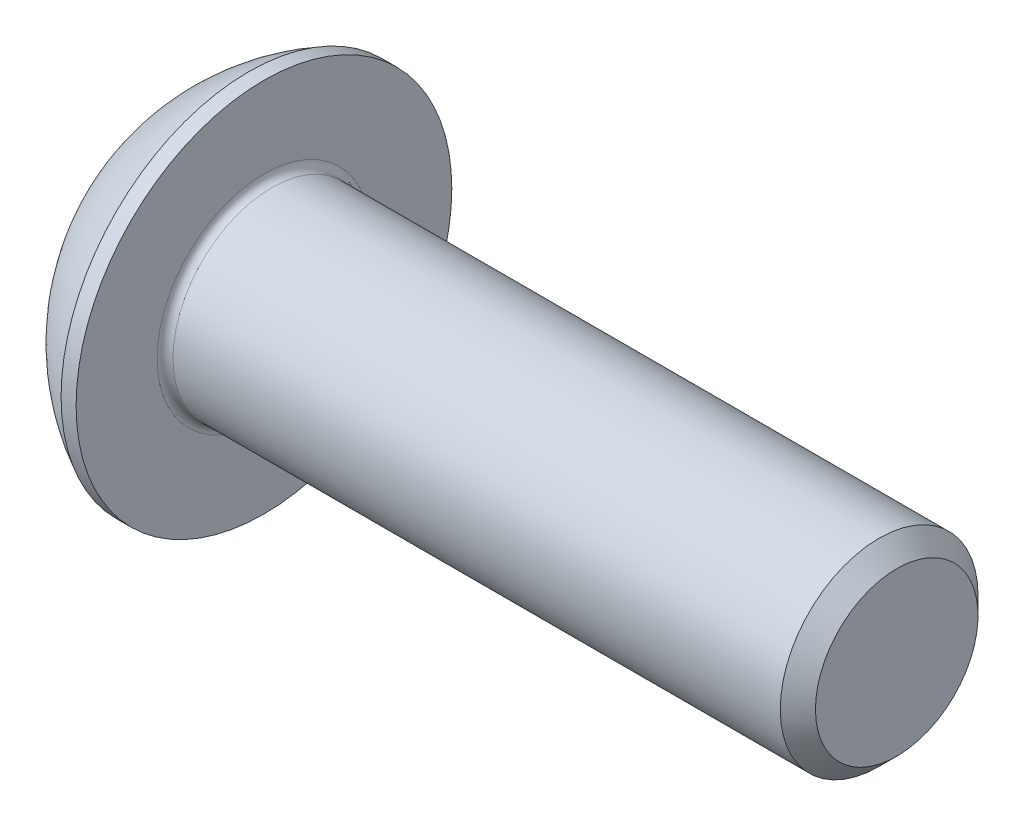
from build123d import *

# Parameters (mm, degrees)
FILLET1_R   = 0.2
HEX_2_DEPTH = 1.56


with BuildPart() as part:
    # BodySke → BaseBody (revolve)
    with BuildSketch(Plane.XY, mode=Mode.PRIVATE) as basebody_sk:
        with BuildLine():
            Line((18.75, 0), (18.75, 2.055))
            Line((18.75, 2.055), (18.305, 2.5))
            Line((18.305, 2.5), (2.75, 2.5))
            Line((2.75, 2.5), (2.75, 4.75))
            Line((2.75, 4.75), (2.37, 4.75))
            ThreePointArc((2.37, 4.75), (0.992680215, 3.754414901), (0, 2.375))
            Line((0, 2.375), (0, 0))
            Line((0, 0), (18.75, 0))
        make_face()
    revolve(basebody_sk.sketch.rotate(Axis((0, 0, 0), (1, 0, 0)), 90), axis=Axis((0, 0, 0), (1, 0, 0)))

    # Fillet1
    fillet1_edges = [part.edges().sort_by_distance(p)[0] for p in [
        (2.75, 0, -2.5),
    ]]
    fillet(fillet1_edges, radius=FILLET1_R)

    # Sketch2 → PreBroach (revolve, cut)
    with BuildSketch(Plane.XY, mode=Mode.PRIVATE) as prebroach_sk:
        Polygon((0, 1.5), (1.56, 1.5), (2.426025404, 0), (0, 0), align=None)
    revolve(prebroach_sk.sketch.rotate(Axis((0, 0, 0), (1, 0, 0)), 90), axis=Axis((0, 0, 0), (1, 0, 0)), mode=Mode.SUBTRACT)

    # Sketch3 → Hex 2 (cut)
    with BuildSketch(Plane(origin=(0, 0, 0), x_dir=(0, 0, -1), z_dir=(1, 0, 0))):
        Polygon((-1.5, -0.866025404), (-1.5, 0.866025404), (0, 1.732050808), (1.5, 0.866025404), (1.5, -0.866025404), (0, -1.732050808), align=None)
    extrude(amount=HEX_2_DEPTH, mode=Mode.SUBTRACT)


solid = part.part
